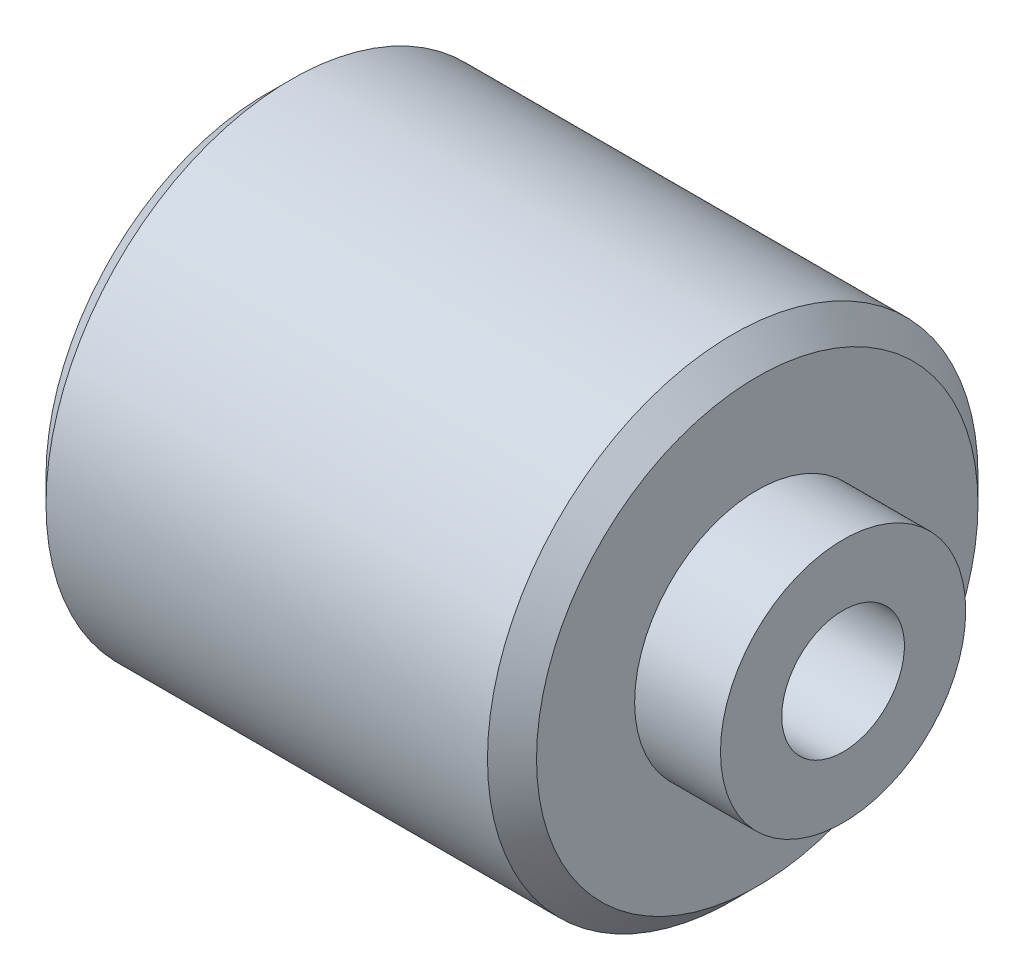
from build123d import *


with BuildPart() as part:
    # Sketch1 → Revolve1 (revolve)
    with BuildSketch(Plane(origin=(0, 0, 0), x_dir=(1, 0, 0), z_dir=(0, 1, 0)), mode=Mode.PRIVATE) as revolve1_sk:
        Polygon((0, 2.5), (23.5, 2.5), (23.5, 5), (20, 5), (20, 9), (19, 10), (1, 10), (0, 9), align=None)
    revolve(revolve1_sk.sketch.rotate(Axis((0, 0, 0), (1, 0, 0)), 180), axis=Axis((0, 0, 0), (1, 0, 0)))


solid = part.part
